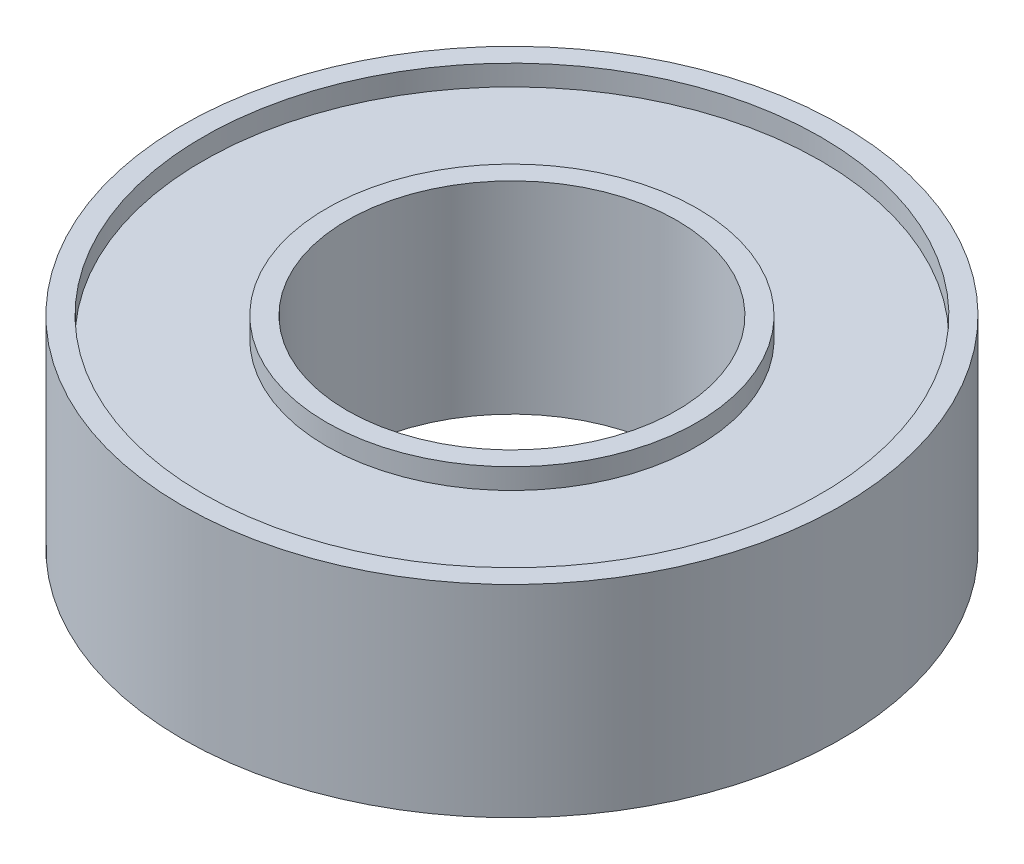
from build123d import *

# Parameters (mm, degrees)
SKETCH1_R      = 6.35
SKETCH1_R_2    = 3.175
EXTRUDE1_DEPTH = 3.89255
SKETCH2_R      = 5.953125
SKETCH2_R_2    = 3.571875
EXTRUDE2_DEPTH = 0.396875
EXTRUDE3_START = -0.396875
SKETCH3_R      = 5.953125
SKETCH3_R_2    = 3.571875
EXTRUDE3_DEPTH = 0.396875


with BuildPart() as part:
    # Sketch1 → Extrude1 (new body)
    with BuildSketch(Plane(origin=(0, 0, 0), x_dir=(1, 0, 0), z_dir=(0, 1, 0))):
        with Locations(Location((-11.336782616, 8.991241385, 0), (0, 0, 270))):
            Circle(SKETCH1_R)
        with Locations(Location((-11.336782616, 8.991241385, 0), (0, 0, 270))):
            Circle(SKETCH1_R_2, mode=Mode.SUBTRACT)
    extrude(amount=EXTRUDE1_DEPTH)

    # Sketch2 → Extrude2 (cut)
    with BuildSketch(Plane(origin=(0, 3.89255, 0), x_dir=(1, 0, 0), z_dir=(0, 1, 0))):
        with Locations(Location((-11.336782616, 8.991241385, 0), (0, 0, 270))):
            Circle(SKETCH2_R)
        with Locations(Location((-11.336782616, 8.991241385, 0), (0, 0, 270))):
            Circle(SKETCH2_R_2, mode=Mode.SUBTRACT)
    extrude(amount=-EXTRUDE2_DEPTH, mode=Mode.SUBTRACT)

    # Sketch3 → Extrude3 (cut)
    with BuildSketch(Plane.XZ.offset(EXTRUDE3_START)):
        with Locations(Location((-11.336782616, -8.991241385, 0), (0, 0, 90))):
            Circle(SKETCH3_R)
        with Locations(Location((-11.336782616, -8.991241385, 0), (0, 0, 90))):
            Circle(SKETCH3_R_2, mode=Mode.SUBTRACT)
    extrude(amount=EXTRUDE3_DEPTH, mode=Mode.SUBTRACT)


solid = part.part
